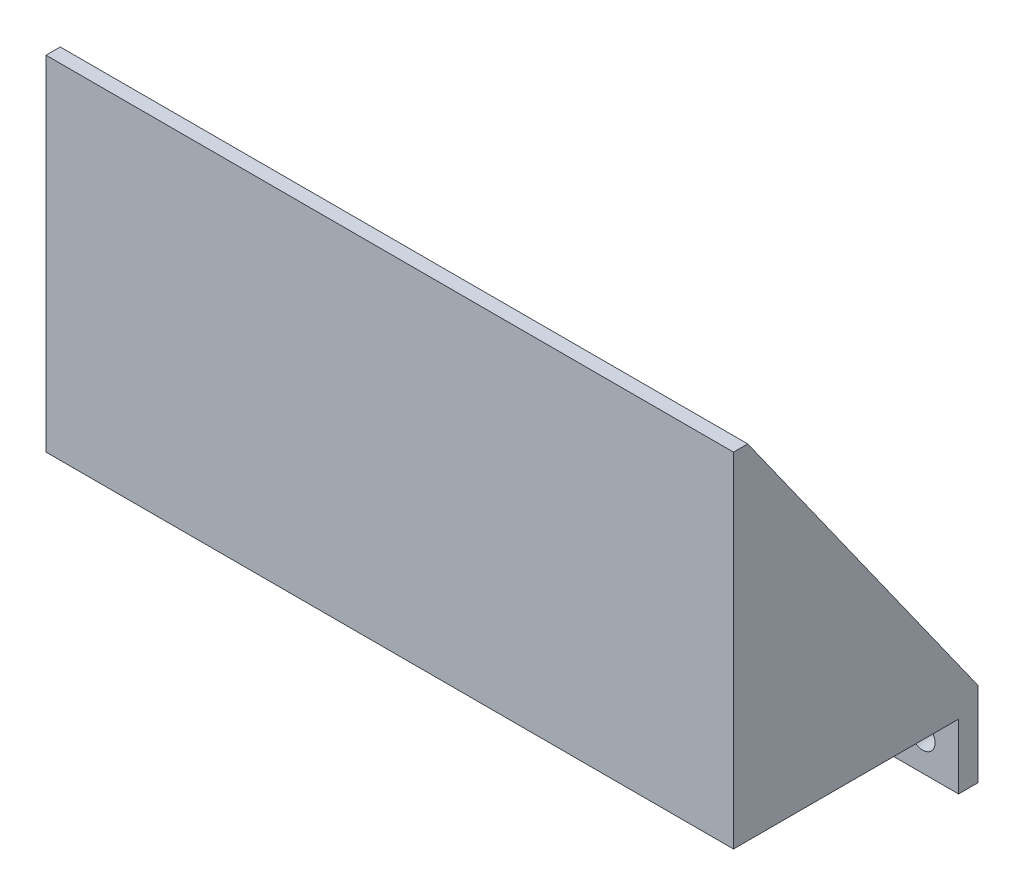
from build123d import *

# Parameters (mm, degrees)
SKETCH1_W               = 3
SKETCH1_H               = 3
SKETCH1_W_2             = 2.5
BOSS_EXTRUDE1_DEPTH     = 50
CUT_EXTRUDE1_DEPTH      = 110
CUT_EXTRUDE1_DEPTH_BACK = 10
SKETCH1_6_W             = 100.5
SKETCH1_6_H             = 3
SKETCH1_6_W_2           = 3
SKETCH1_6_W_3           = 2.5
BOSS_EXTRUDE4_DEPTH     = 13
SKETCH1_8_W             = 100.5
SKETCH1_8_H             = 32.5
BOSS_EXTRUDE5_DEPTH     = 3
SKETCH3_R               = 1.9
CUT_EXTRUDE2_DEPTH      = 3


with BuildPart() as part:
    # Sketch1 → Boss-Extrude1 (new body)
    with BuildSketch(Plane(origin=(0, 0, 0), x_dir=(1, 0, 0), z_dir=(0, 1, 0))):
        Polygon((103, 35.5), (103, -2.197380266), (-3, -2.197380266), (-3, 35.5), (0, 35.5), (0, 0), (100.5, 0), (100.5, 35.5), align=None)
        with Locations((-1.5, 34)):
            Rectangle(SKETCH1_W, SKETCH1_H)
        with Locations((101.75, 34)):
            Rectangle(SKETCH1_W_2, SKETCH1_H)
    extrude(amount=BOSS_EXTRUDE1_DEPTH)

    # Sketch2 → Cut-Extrude1 (cut, two sides: drawn at the far end of the back side and taken through both)
    with BuildSketch(Plane(origin=(0, 0, 0), x_dir=(0, 0, -1), z_dir=(1, 0, 0)).offset(-CUT_EXTRUDE1_DEPTH_BACK)):
        Polygon((35.5, 0), (0, 50), (35.5, 50), align=None)
    extrude(amount=CUT_EXTRUDE1_DEPTH + CUT_EXTRUDE1_DEPTH_BACK, mode=Mode.SUBTRACT)



with BuildPart() as body_2:
    # Sketch1_6 → Boss-Extrude4 (new body)
    with BuildSketch(Plane(origin=(0, 0, 0), x_dir=(1, 0, 0), z_dir=(0, 1, 0))):
        with Locations((50.25, 34)):
            Rectangle(SKETCH1_6_W, SKETCH1_6_H)
        with Locations((-1.5, 34)):
            Rectangle(SKETCH1_6_W_2, SKETCH1_6_H)
        with Locations((101.75, 34)):
            Rectangle(SKETCH1_6_W_3, SKETCH1_6_H)
    extrude(amount=-BOSS_EXTRUDE4_DEPTH)


with BuildPart() as part_1:
    add(part.part)

    add(body_2.part)  # Boss-Extrude5 merges body 2
    # Sketch1_8 → Boss-Extrude5 (add)
    with BuildSketch(Plane(origin=(0, 0, 0), x_dir=(1, 0, 0), z_dir=(0, 1, 0))):
        with Locations((50.25, 16.25)):
            Rectangle(SKETCH1_8_W, SKETCH1_8_H)
        Polygon((0, 32.5), (-3, 32.5), (-3, -2.197380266), (103, -2.197380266), (103, 32.5), (100.5, 32.5), (100.5, 0), (0, 0), align=None)
    extrude(amount=-BOSS_EXTRUDE5_DEPTH)

    # Sketch3 → Cut-Extrude2 (cut)
    with BuildSketch(Plane.XY.offset(-32.5)):
        with Locations((2.514278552, -8)):
            Circle(SKETCH3_R)
        with Locations((97.485721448, -8)):
            Circle(SKETCH3_R)
    extrude(amount=-CUT_EXTRUDE2_DEPTH, mode=Mode.SUBTRACT)


solid = part_1.part
